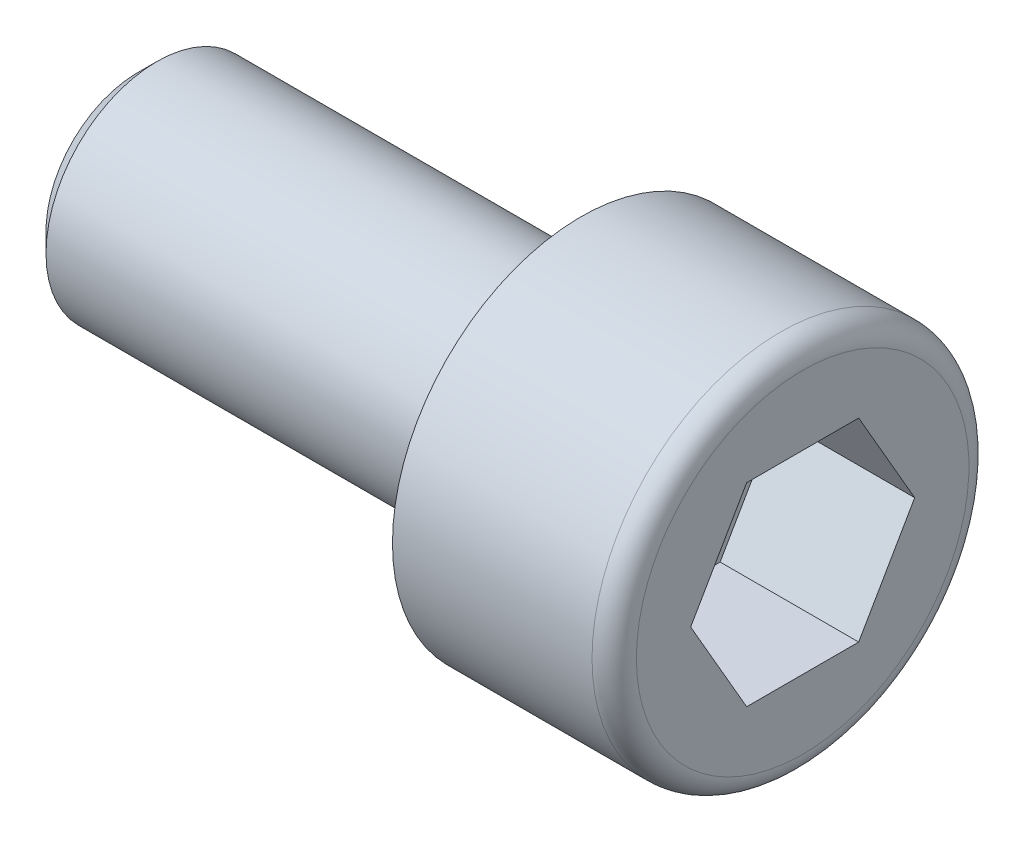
from build123d import *

# Parameters (mm, degrees)
CHANFREIN1_SIZE         = 0.35
ENL_V_MAT_EXTRU_1_DEPTH = 2.5


with BuildPart() as part:
    # Esquisse1 → Base-R_volution (revolve)
    with BuildSketch(Plane.XY, mode=Mode.PRIVATE) as base_r_volution_sk:
        with BuildLine():
            Line((0, 2), (0, 3.4))
            Line((0, 3.4), (3.6, 3.4))
            ThreePointArc((3.6, 3.4), (3.882842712, 3.282842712), (4, 3))
            Line((4, 3), (4, 1.75))
            Line((4, 1.75), (1.5, 1.75))
            Line((1.5, 1.75), (1.5, 0))
            Line((1.5, 0), (-8, 0))
            Line((-8, 0), (-8, 2))
            Line((-8, 2), (0, 2))
        make_face()
    revolve(base_r_volution_sk.sketch.rotate(Axis((-30, 0, 0), (1, 0, 0)), 90), axis=Axis((-30, 0, 0), (1, 0, 0)))

    # Chanfrein1
    chanfrein1_edges = [part.edges().sort_by_distance(p)[0] for p in [
        (-8, 0, -2),
    ]]
    chamfer(chanfrein1_edges, length=CHANFREIN1_SIZE)

    # Esquisse2 → Enl_v. mat.-Extru.1 (cut)
    with BuildSketch(Plane(origin=(4, 0, 0), x_dir=(0, 0, -1), z_dir=(1, 0, 0))):
        Polygon((-2.020725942, 0), (-1.010362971, -1.75), (1.010362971, -1.75), (2.020725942, 0), (1.010362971, 1.75), (-1.010362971, 1.75), align=None)
    extrude(amount=-ENL_V_MAT_EXTRU_1_DEPTH, mode=Mode.SUBTRACT)


solid = part.part
